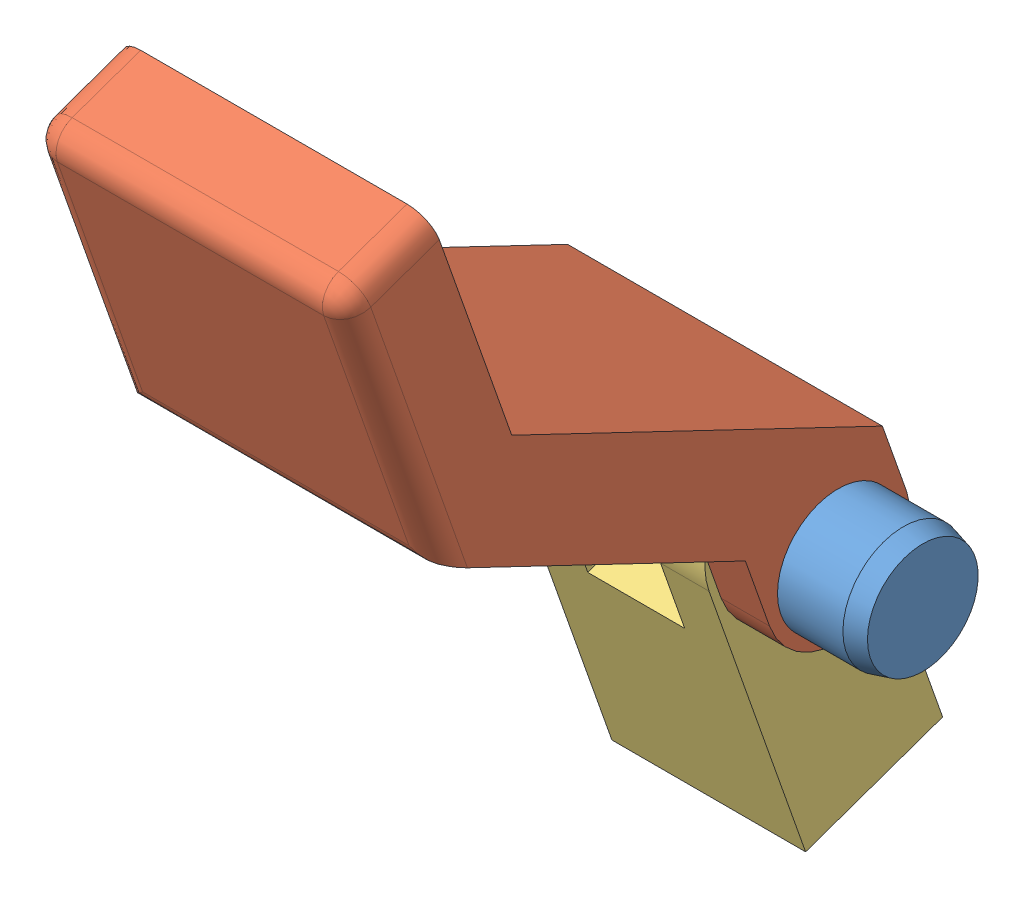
SolidWorks assembly Pedal.SLDASM, configuration Default (file format 15000). Lengths in mm.
Overall size (100 184.45 136.96).
3 component instances, 3 part files, 5 mates.
Components (placement in the parent):
- Pin-1: Pin.SLDPRT [Default] at (-33.4216 8.9863 37.9034) size (100 25 25)
- Pedal (Foot part)-1: Pedal (Foot part).SLDPRT [Default] at (11.3891 68.9369 65.7553) x (1 0 0) z (0 -0.943108 -0.332486) size (65 80 140)
- Pedal Connector-1: Pedal Connector.SLDPRT [Default] at (23.8891 30.6691 84.074) x (1 0 0) z (0 0.943108 0.332486) size (40 30 75)
Mates (geometry in assembly coordinates):
- Concentric1: concentric aligned: cylinder of Pin-1 through (-12.4609 49.803 74.9146) axis (-1 0 0) radius 12.5; cylinder of Pedal (Foot part)-1 through (76.3891 49.803 74.9146) axis (-1 0 0) radius 12.5
- Concentric2: concentric anti-aligned: cylinder of Pin-1 through (-12.4609 49.803 74.9146) axis (-1 0 0) radius 12.5; cylinder of Pedal Connector-1 through (53.8891 49.803 74.9146) axis (1 0 0) radius 12.5
- Parallel1: parallel aligned: plane of Pedal (Foot part)-1 through (76.3891 152.7297 158.9152) normal (0 0.332486 -0.943108); plane of Pedal Connector-1 through (23.8891 40.6436 55.7807) normal (0 0.332486 -0.943108)
- Distance1: distance = 17.5 mm aligned: plane of Pedal (Foot part)-1 through (11.3891 49.803 74.9146) normal (-1 0 0); plane of Pin-1 through (-6.1109 61.2312 74.9146) normal (-1 0 0)
- Distance2: distance = 30 mm aligned: plane of Pedal Connector-1 through (23.8891 40.6436 55.7807) normal (-1 0 0); plane of Pin-1 through (-6.1109 61.2312 74.9146) normal (-1 0 0)
